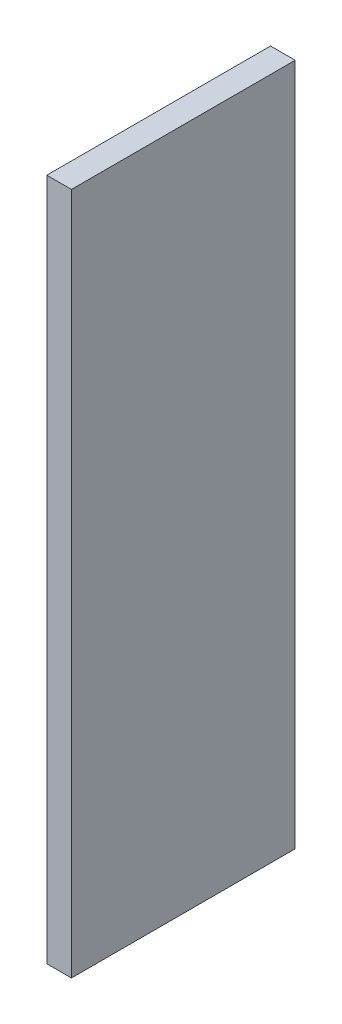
ISO-10303-21;
HEADER;
FILE_DESCRIPTION(('STEP AP214'),'2;1');
FILE_NAME('part.step','',(''),(''),'','','');
FILE_SCHEMA(('AUTOMOTIVE_DESIGN { 1 0 10303 214 1 1 1 1 }'));
ENDSEC;
DATA;
#1=APPLICATION_CONTEXT('core data for automotive mechanical design processes');
#2=APPLICATION_PROTOCOL_DEFINITION('international standard','automotive_design',2000,#1);
#3=PRODUCT_CONTEXT('',#1,'mechanical');
#4=PRODUCT('Part','Part','',(#3));
#5=PRODUCT_RELATED_PRODUCT_CATEGORY('part','',(#4));
#6=PRODUCT_DEFINITION_FORMATION('','',#4);
#7=PRODUCT_DEFINITION_CONTEXT('part definition',#1,'design');
#8=PRODUCT_DEFINITION('design','',#6,#7);
#9=PRODUCT_DEFINITION_SHAPE('','',#8);
#10=(LENGTH_UNIT() NAMED_UNIT(*) SI_UNIT(.MILLI.,.METRE.));
#11=(NAMED_UNIT(*) PLANE_ANGLE_UNIT() SI_UNIT($,.RADIAN.));
#12=(NAMED_UNIT(*) SI_UNIT($,.STERADIAN.) SOLID_ANGLE_UNIT());
#13=UNCERTAINTY_MEASURE_WITH_UNIT(LENGTH_MEASURE(1.E-05),#10,'distance_accuracy_value','');
#14=(GEOMETRIC_REPRESENTATION_CONTEXT(3) GLOBAL_UNCERTAINTY_ASSIGNED_CONTEXT((#13)) GLOBAL_UNIT_ASSIGNED_CONTEXT((#10,
#11,#12)) REPRESENTATION_CONTEXT('',''));
#15=CARTESIAN_POINT('',(0.,0.,0.));
#16=DIRECTION('',(0.,0.,1.));
#17=DIRECTION('',(1.,0.,0.));
#18=AXIS2_PLACEMENT_3D('',#15,#16,#17);
#19=CARTESIAN_POINT('',(0.,0.,114.05));
#20=DIRECTION('',(0.,0.,-1.));
#21=DIRECTION('',(-1.,0.,0.));
#22=AXIS2_PLACEMENT_3D('',#19,#20,#21);
#23=PLANE('',#22);
#24=DIRECTION('',(0.,1.,0.));
#25=VECTOR('',#24,1.);
#26=CARTESIAN_POINT('',(45.0875,-43.99,114.05));
#27=LINE('',#26,#25);
#28=CARTESIAN_POINT('',(45.0875,-43.99,114.05));
#29=VERTEX_POINT('',#28);
#30=CARTESIAN_POINT('',(45.0875,43.99,114.05));
#31=VERTEX_POINT('',#30);
#32=EDGE_CURVE('E82',#29,#31,#27,.T.);
#33=ORIENTED_EDGE('',*,*,#32,.F.);
#34=DIRECTION('',(1.,0.,0.));
#35=VECTOR('',#34,1.);
#36=CARTESIAN_POINT('',(41.9125,-43.99,114.05));
#37=LINE('',#36,#35);
#38=CARTESIAN_POINT('',(41.9125,-43.99,114.05));
#39=VERTEX_POINT('',#38);
#40=EDGE_CURVE('E93',#39,#29,#37,.T.);
#41=ORIENTED_EDGE('',*,*,#40,.F.);
#42=DIRECTION('',(0.,-1.,0.));
#43=VECTOR('',#42,1.);
#44=CARTESIAN_POINT('',(41.9125,-43.99,114.05));
#45=LINE('',#44,#43);
#46=CARTESIAN_POINT('',(41.9125,43.99,114.05));
#47=VERTEX_POINT('',#46);
#48=EDGE_CURVE('E84',#47,#39,#45,.T.);
#49=ORIENTED_EDGE('',*,*,#48,.F.);
#50=DIRECTION('',(-1.,0.,0.));
#51=VECTOR('',#50,1.);
#52=CARTESIAN_POINT('',(41.9125,43.99,114.05));
#53=LINE('',#52,#51);
#54=EDGE_CURVE('E74',#31,#47,#53,.T.);
#55=ORIENTED_EDGE('',*,*,#54,.F.);
#56=EDGE_LOOP('',(#33,#41,#49,#55));
#57=FACE_BOUND('',#56,.T.);
#58=ADVANCED_FACE('F32',(#57),#23,.T.);
#59=CARTESIAN_POINT('',(41.9125,-43.99,230.912270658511));
#60=DIRECTION('',(0.,1.,0.));
#61=DIRECTION('',(0.,0.,1.));
#62=AXIS2_PLACEMENT_3D('',#59,#60,#61);
#63=PLANE('',#62);
#64=DIRECTION('',(0.,0.,-1.));
#65=VECTOR('',#64,1.);
#66=CARTESIAN_POINT('',(45.0875,-43.99,230.912270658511));
#67=LINE('',#66,#65);
#68=CARTESIAN_POINT('',(45.0875,-43.99,142.875));
#69=VERTEX_POINT('',#68);
#70=EDGE_CURVE('E87',#69,#29,#67,.T.);
#71=ORIENTED_EDGE('',*,*,#70,.F.);
#72=DIRECTION('',(-1.,0.,0.));
#73=VECTOR('',#72,1.);
#74=CARTESIAN_POINT('',(41.9125,-43.99,142.875));
#75=LINE('',#74,#73);
#76=CARTESIAN_POINT('',(41.9125,-43.99,142.875));
#77=VERTEX_POINT('',#76);
#78=EDGE_CURVE('E36',#69,#77,#75,.T.);
#79=ORIENTED_EDGE('',*,*,#78,.T.);
#80=DIRECTION('',(0.,0.,-1.));
#81=VECTOR('',#80,1.);
#82=CARTESIAN_POINT('',(41.9125,-43.99,230.912270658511));
#83=LINE('',#82,#81);
#84=EDGE_CURVE('E96',#77,#39,#83,.T.);
#85=ORIENTED_EDGE('',*,*,#84,.T.);
#86=ORIENTED_EDGE('',*,*,#40,.T.);
#87=EDGE_LOOP('',(#71,#79,#85,#86));
#88=FACE_BOUND('',#87,.T.);
#89=ADVANCED_FACE('F105',(#88),#63,.F.);
#90=CARTESIAN_POINT('',(41.9125,-43.99,230.912270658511));
#91=DIRECTION('',(1.,0.,0.));
#92=DIRECTION('',(0.,0.,-1.));
#93=AXIS2_PLACEMENT_3D('',#90,#91,#92);
#94=PLANE('',#93);
#95=ORIENTED_EDGE('',*,*,#84,.F.);
#96=DIRECTION('',(0.,1.,0.));
#97=VECTOR('',#96,1.);
#98=CARTESIAN_POINT('',(41.9125,-43.99,142.875));
#99=LINE('',#98,#97);
#100=CARTESIAN_POINT('',(41.9125,43.99,142.875));
#101=VERTEX_POINT('',#100);
#102=EDGE_CURVE('E102',#77,#101,#99,.T.);
#103=ORIENTED_EDGE('',*,*,#102,.T.);
#104=DIRECTION('',(0.,0.,-1.));
#105=VECTOR('',#104,1.);
#106=CARTESIAN_POINT('',(41.9125,43.99,230.912270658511));
#107=LINE('',#106,#105);
#108=EDGE_CURVE('E78',#101,#47,#107,.T.);
#109=ORIENTED_EDGE('',*,*,#108,.T.);
#110=ORIENTED_EDGE('',*,*,#48,.T.);
#111=EDGE_LOOP('',(#95,#103,#109,#110));
#112=FACE_BOUND('',#111,.T.);
#113=ADVANCED_FACE('F101',(#112),#94,.F.);
#114=CARTESIAN_POINT('',(41.9125,43.99,230.912270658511));
#115=DIRECTION('',(0.,-1.,0.));
#116=DIRECTION('',(0.,0.,-1.));
#117=AXIS2_PLACEMENT_3D('',#114,#115,#116);
#118=PLANE('',#117);
#119=ORIENTED_EDGE('',*,*,#108,.F.);
#120=DIRECTION('',(1.,0.,0.));
#121=VECTOR('',#120,1.);
#122=CARTESIAN_POINT('',(41.9125,43.99,142.875));
#123=LINE('',#122,#121);
#124=CARTESIAN_POINT('',(45.0875,43.99,142.875));
#125=VERTEX_POINT('',#124);
#126=EDGE_CURVE('E41',#101,#125,#123,.T.);
#127=ORIENTED_EDGE('',*,*,#126,.T.);
#128=DIRECTION('',(0.,0.,-1.));
#129=VECTOR('',#128,1.);
#130=CARTESIAN_POINT('',(45.0875,43.99,230.912270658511));
#131=LINE('',#130,#129);
#132=EDGE_CURVE('E71',#125,#31,#131,.T.);
#133=ORIENTED_EDGE('',*,*,#132,.T.);
#134=ORIENTED_EDGE('',*,*,#54,.T.);
#135=EDGE_LOOP('',(#119,#127,#133,#134));
#136=FACE_BOUND('',#135,.T.);
#137=ADVANCED_FACE('F73',(#136),#118,.F.);
#138=CARTESIAN_POINT('',(45.0875,-43.99,230.912270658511));
#139=DIRECTION('',(-1.,0.,0.));
#140=DIRECTION('',(0.,0.,1.));
#141=AXIS2_PLACEMENT_3D('',#138,#139,#140);
#142=PLANE('',#141);
#143=ORIENTED_EDGE('',*,*,#132,.F.);
#144=DIRECTION('',(0.,-1.,0.));
#145=VECTOR('',#144,1.);
#146=CARTESIAN_POINT('',(45.0875,-43.99,142.875));
#147=LINE('',#146,#145);
#148=EDGE_CURVE('E11',#125,#69,#147,.T.);
#149=ORIENTED_EDGE('',*,*,#148,.T.);
#150=ORIENTED_EDGE('',*,*,#70,.T.);
#151=ORIENTED_EDGE('',*,*,#32,.T.);
#152=EDGE_LOOP('',(#143,#149,#150,#151));
#153=FACE_BOUND('',#152,.T.);
#154=ADVANCED_FACE('F34',(#153),#142,.F.);
#155=CARTESIAN_POINT('',(-69.675,58.9125,142.875));
#156=DIRECTION('',(0.,0.,-1.));
#157=DIRECTION('',(0.,1.,0.));
#158=AXIS2_PLACEMENT_3D('',#155,#156,#157);
#159=PLANE('',#158);
#160=ORIENTED_EDGE('',*,*,#126,.F.);
#161=ORIENTED_EDGE('',*,*,#102,.F.);
#162=ORIENTED_EDGE('',*,*,#78,.F.);
#163=ORIENTED_EDGE('',*,*,#148,.F.);
#164=EDGE_LOOP('',(#160,#161,#162,#163));
#165=FACE_BOUND('',#164,.T.);
#166=ADVANCED_FACE('F119',(#165),#159,.F.);
#167=CLOSED_SHELL('',(#58,#89,#113,#137,#154,#166));
#168=MANIFOLD_SOLID_BREP('B2',#167);
#169=ADVANCED_BREP_SHAPE_REPRESENTATION('',(#18,#168),#14);
#170=SHAPE_DEFINITION_REPRESENTATION(#9,#169);
ENDSEC;
END-ISO-10303-21;
